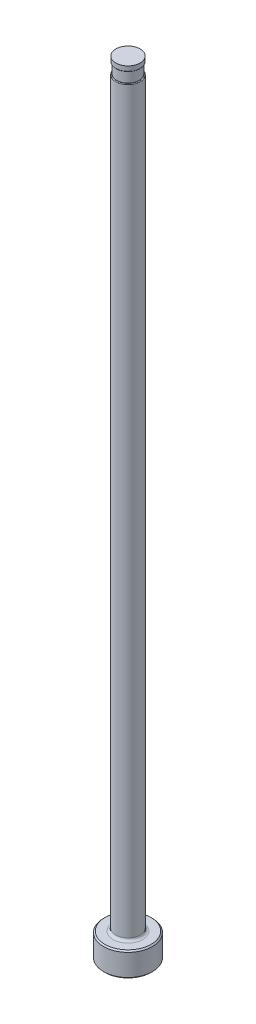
from build123d import *

# Parameters (mm, degrees)
CHAMFER1_SIZE     = 0.254
FILLET1_R         = 0.508
SKETCH2_W         = 0.2032
SKETCH2_H         = 2.032
D_SLOT_DEPTH      = 153.548755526
D_SLOT_DEPTH_BACK = 153.548755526
SKETCH5_W         = 0.00508
SKETCH5_H         = 1.016
FILLET2_R         = 0.127


with BuildPart() as part:
    # Sketch1 → Revolve1 (revolve)
    with BuildSketch(Plane.XY, mode=Mode.PRIVATE) as revolve1_sk:
        Polygon((0, 0), (-4.7625, 0), (-4.7625, 4.7498), (-2.38125, 4.7498), (-2.38125, 152.4), (0, 152.4), align=None)
    revolve(revolve1_sk.sketch.rotate(Axis((0, 259.958771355, 0), (0, -1, 0)), 270), axis=Axis((0, 259.958771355, 0), (0, -1, 0)))

    # Chamfer1
    chamfer1_edges = [part.edges().sort_by_distance(p)[0] for p in [
        (0, 4.7498, -4.7625),
        (0, 0, -4.7625),
    ]]
    chamfer(chamfer1_edges, length=CHAMFER1_SIZE)

    # Fillet1
    fillet1_edges = [part.edges().sort_by_distance(p)[0] for p in [
        (0, 4.7498, -2.38125),
    ]]
    fillet(fillet1_edges, radius=FILLET1_R)

    # Sketch2 → Vent Relief (revolve, cut)
    with BuildSketch(Plane.XY, mode=Mode.PRIVATE) as vent_relief_sk:
        with Locations((-2.27965, 150.368)):
            Rectangle(SKETCH2_W, SKETCH2_H)
    revolve(vent_relief_sk.sketch.rotate(Axis((0, 153.448281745, 0), (0, -1, 0)), 270), axis=Axis((0, 153.448281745, 0), (0, -1, 0)), mode=Mode.SUBTRACT)

    # Sketch3 → D-Slot (cut, two sides: drawn at the far end of the back side and taken through both)
    with BuildSketch(Plane.XY.offset(-D_SLOT_DEPTH_BACK)):
        with BuildLine():
            Line((-2.17805, 150.368), (-2.17805, 86.868))
            ThreePointArc((-2.17805, 86.868), (-2.229263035, 86.300038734), (-2.38125, 85.7504))
            Line((-2.38125, 85.7504), (-2.38125, 150.368))
            Line((-2.38125, 150.368), (-2.17805, 150.368))
        make_face()
    extrude(amount=D_SLOT_DEPTH + D_SLOT_DEPTH_BACK, mode=Mode.SUBTRACT)

    # Sketch5 → Vent Diameter (revolve, cut)
    with BuildSketch(Plane.XY, mode=Mode.PRIVATE) as vent_diameter_sk:
        with Locations((-2.37871, 151.892)):
            Rectangle(SKETCH5_W, SKETCH5_H)
    revolve(vent_diameter_sk.sketch.rotate(Axis((0, 152.687735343, 0), (0, -1, 0)), 90), axis=Axis((0, 152.687735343, 0), (0, -1, 0)), mode=Mode.SUBTRACT)

    # Fillet2
    fillet2_edges = [part.edges().sort_by_distance(p)[0] for p in [
        (1.995289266, 149.352, -1.299681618),
        (0, 151.384, 2.37617),
    ]]
    fillet(fillet2_edges, radius=FILLET2_R)


solid = part.part
